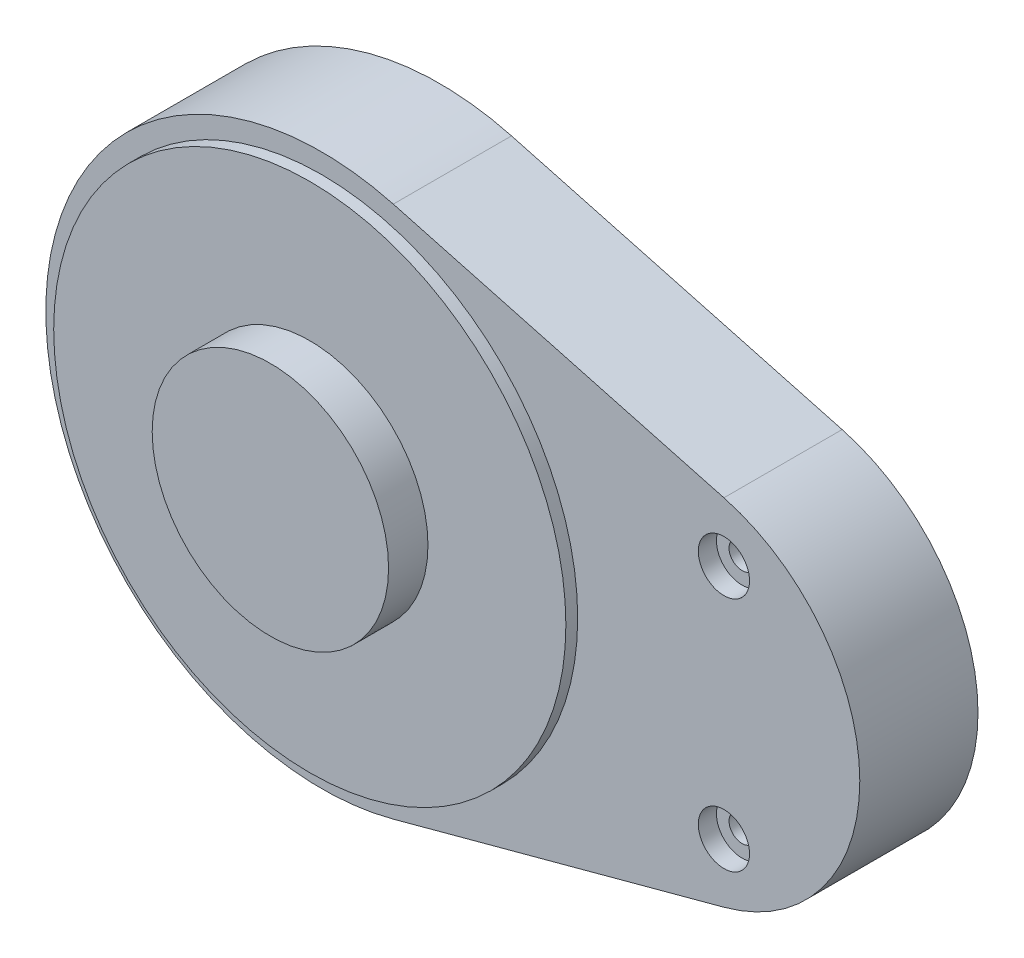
ISO-10303-21;
HEADER;
FILE_DESCRIPTION(('STEP AP214'),'2;1');
FILE_NAME('part.step','',(''),(''),'','','');
FILE_SCHEMA(('AUTOMOTIVE_DESIGN { 1 0 10303 214 1 1 1 1 }'));
ENDSEC;
DATA;
#1=APPLICATION_CONTEXT('core data for automotive mechanical design processes');
#2=APPLICATION_PROTOCOL_DEFINITION('international standard','automotive_design',2000,#1);
#3=PRODUCT_CONTEXT('',#1,'mechanical');
#4=PRODUCT('Part','Part','',(#3));
#5=PRODUCT_RELATED_PRODUCT_CATEGORY('part','',(#4));
#6=PRODUCT_DEFINITION_FORMATION('','',#4);
#7=PRODUCT_DEFINITION_CONTEXT('part definition',#1,'design');
#8=PRODUCT_DEFINITION('design','',#6,#7);
#9=PRODUCT_DEFINITION_SHAPE('','',#8);
#10=(LENGTH_UNIT() NAMED_UNIT(*) SI_UNIT(.MILLI.,.METRE.));
#11=(NAMED_UNIT(*) PLANE_ANGLE_UNIT() SI_UNIT($,.RADIAN.));
#12=(NAMED_UNIT(*) SI_UNIT($,.STERADIAN.) SOLID_ANGLE_UNIT());
#13=UNCERTAINTY_MEASURE_WITH_UNIT(LENGTH_MEASURE(1.E-05),#10,'distance_accuracy_value','');
#14=(GEOMETRIC_REPRESENTATION_CONTEXT(3) GLOBAL_UNCERTAINTY_ASSIGNED_CONTEXT((#13)) GLOBAL_UNIT_ASSIGNED_CONTEXT((#10,
#11,#12)) REPRESENTATION_CONTEXT('',''));
#15=CARTESIAN_POINT('',(0.,0.,0.));
#16=DIRECTION('',(0.,0.,1.));
#17=DIRECTION('',(1.,0.,0.));
#18=AXIS2_PLACEMENT_3D('',#15,#16,#17);
#19=CARTESIAN_POINT('',(0.,127.009473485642,0.));
#20=DIRECTION('',(0.,0.,1.));
#21=DIRECTION('',(1.,0.,0.));
#22=AXIS2_PLACEMENT_3D('',#19,#20,#21);
#23=PLANE('',#22);
#24=CARTESIAN_POINT('',(12.1153844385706,157.009473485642,0.));
#25=DIRECTION('',(0.,0.,1.));
#26=DIRECTION('',(1.,0.,0.));
#27=AXIS2_PLACEMENT_3D('',#24,#25,#26);
#28=CIRCLE('',#27,3.29999999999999);
#29=CARTESIAN_POINT('',(15.4153844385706,157.009473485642,0.));
#30=VERTEX_POINT('',#29);
#31=EDGE_CURVE('E36',#30,#30,#28,.T.);
#32=ORIENTED_EDGE('',*,*,#31,.T.);
#33=EDGE_LOOP('',(#32));
#34=FACE_BOUND('',#33,.T.);
#35=CARTESIAN_POINT('',(12.1153844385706,97.009473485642,0.));
#36=DIRECTION('',(0.,0.,1.));
#37=DIRECTION('',(1.,0.,0.));
#38=AXIS2_PLACEMENT_3D('',#35,#36,#37);
#39=CIRCLE('',#38,3.29999999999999);
#40=CARTESIAN_POINT('',(15.4153844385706,97.009473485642,0.));
#41=VERTEX_POINT('',#40);
#42=EDGE_CURVE('E154',#41,#41,#39,.T.);
#43=ORIENTED_EDGE('',*,*,#42,.T.);
#44=EDGE_LOOP('',(#43));
#45=FACE_BOUND('',#44,.T.);
#46=CARTESIAN_POINT('',(0.,127.009473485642,0.));
#47=DIRECTION('',(0.,0.,1.));
#48=DIRECTION('',(1.,0.,0.));
#49=AXIS2_PLACEMENT_3D('',#46,#47,#48);
#50=CIRCLE('',#49,46.6023877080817);
#51=CARTESIAN_POINT('',(12.1153844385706,82.0094734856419,0.));
#52=VERTEX_POINT('',#51);
#53=CARTESIAN_POINT('',(12.1153844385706,172.009473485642,0.));
#54=VERTEX_POINT('',#53);
#55=EDGE_CURVE('E120',#52,#54,#50,.T.);
#56=ORIENTED_EDGE('',*,*,#55,.F.);
#57=DIRECTION('',(0.965615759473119,0.259973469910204,0.));
#58=VECTOR('',#57,1.);
#59=CARTESIAN_POINT('',(-71.8018571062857,59.4163703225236,0.));
#60=LINE('',#59,#58);
#61=CARTESIAN_POINT('',(-71.8018571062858,59.4163703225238,0.));
#62=VERTEX_POINT('',#61);
#63=EDGE_CURVE('E133',#62,#52,#60,.T.);
#64=ORIENTED_EDGE('',*,*,#63,.F.);
#65=CARTESIAN_POINT('',(-90.0000000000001,127.009473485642,0.));
#66=DIRECTION('',(0.,0.,1.));
#67=DIRECTION('',(1.,0.,0.));
#68=AXIS2_PLACEMENT_3D('',#65,#66,#67);
#69=CIRCLE('',#68,70.0000000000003);
#70=CARTESIAN_POINT('',(-71.8018571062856,194.602576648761,0.));
#71=VERTEX_POINT('',#70);
#72=EDGE_CURVE('E141',#71,#62,#69,.T.);
#73=ORIENTED_EDGE('',*,*,#72,.F.);
#74=DIRECTION('',(-0.965615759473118,0.259973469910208,0.));
#75=VECTOR('',#74,1.);
#76=CARTESIAN_POINT('',(12.1153844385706,172.009473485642,0.));
#77=LINE('',#76,#75);
#78=EDGE_CURVE('E123',#54,#71,#77,.T.);
#79=ORIENTED_EDGE('',*,*,#78,.F.);
#80=EDGE_LOOP('',(#56,#64,#73,#79));
#81=FACE_BOUND('',#80,.T.);
#82=DIRECTION('',(0.,1.,0.));
#83=VECTOR('',#82,1.);
#84=CARTESIAN_POINT('',(-105.,142.009473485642,0.));
#85=LINE('',#84,#83);
#86=CARTESIAN_POINT('',(-105.,112.009473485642,0.));
#87=VERTEX_POINT('',#86);
#88=CARTESIAN_POINT('',(-105.,142.009473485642,0.));
#89=VERTEX_POINT('',#88);
#90=EDGE_CURVE('E119',#87,#89,#85,.T.);
#91=ORIENTED_EDGE('',*,*,#90,.F.);
#92=DIRECTION('',(-1.,0.,0.));
#93=VECTOR('',#92,1.);
#94=CARTESIAN_POINT('',(-105.,112.009473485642,0.));
#95=LINE('',#94,#93);
#96=CARTESIAN_POINT('',(-75.,112.009473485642,0.));
#97=VERTEX_POINT('',#96);
#98=EDGE_CURVE('E116',#97,#87,#95,.T.);
#99=ORIENTED_EDGE('',*,*,#98,.F.);
#100=DIRECTION('',(0.,-1.,0.));
#101=VECTOR('',#100,1.);
#102=CARTESIAN_POINT('',(-75.,142.009473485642,0.));
#103=LINE('',#102,#101);
#104=CARTESIAN_POINT('',(-75.,142.009473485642,0.));
#105=VERTEX_POINT('',#104);
#106=EDGE_CURVE('E54',#105,#97,#103,.T.);
#107=ORIENTED_EDGE('',*,*,#106,.F.);
#108=DIRECTION('',(1.,0.,0.));
#109=VECTOR('',#108,1.);
#110=CARTESIAN_POINT('',(-105.,142.009473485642,0.));
#111=LINE('',#110,#109);
#112=EDGE_CURVE('E49',#89,#105,#111,.T.);
#113=ORIENTED_EDGE('',*,*,#112,.F.);
#114=EDGE_LOOP('',(#91,#99,#107,#113));
#115=FACE_BOUND('',#114,.T.);
#116=ADVANCED_FACE('F32',(#34,#45,#81,#115),#23,.F.);
#117=CARTESIAN_POINT('',(0.,127.009473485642,30.));
#118=DIRECTION('',(0.,0.,-1.));
#119=DIRECTION('',(-1.,0.,0.));
#120=AXIS2_PLACEMENT_3D('',#117,#118,#119);
#121=CYLINDRICAL_SURFACE('',#120,46.6023877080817);
#122=ORIENTED_EDGE('',*,*,#55,.T.);
#123=DIRECTION('',(0.,0.,-1.));
#124=VECTOR('',#123,1.);
#125=CARTESIAN_POINT('',(12.1153844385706,172.009473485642,30.));
#126=LINE('',#125,#124);
#127=CARTESIAN_POINT('',(12.1153844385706,172.009473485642,30.));
#128=VERTEX_POINT('',#127);
#129=EDGE_CURVE('E152',#128,#54,#126,.T.);
#130=ORIENTED_EDGE('',*,*,#129,.F.);
#131=CARTESIAN_POINT('',(0.,127.009473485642,30.));
#132=DIRECTION('',(0.,0.,1.));
#133=DIRECTION('',(1.,0.,0.));
#134=AXIS2_PLACEMENT_3D('',#131,#132,#133);
#135=CIRCLE('',#134,46.6023877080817);
#136=CARTESIAN_POINT('',(12.1153844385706,82.0094734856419,30.));
#137=VERTEX_POINT('',#136);
#138=EDGE_CURVE('E129',#137,#128,#135,.T.);
#139=ORIENTED_EDGE('',*,*,#138,.F.);
#140=DIRECTION('',(0.,0.,-1.));
#141=VECTOR('',#140,1.);
#142=CARTESIAN_POINT('',(12.1153844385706,82.0094734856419,30.));
#143=LINE('',#142,#141);
#144=EDGE_CURVE('E138',#137,#52,#143,.T.);
#145=ORIENTED_EDGE('',*,*,#144,.T.);
#146=EDGE_LOOP('',(#122,#130,#139,#145));
#147=FACE_BOUND('',#146,.T.);
#148=ADVANCED_FACE('F34',(#147),#121,.T.);
#149=CARTESIAN_POINT('',(12.1153844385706,172.009473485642,30.));
#150=DIRECTION('',(-0.259973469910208,-0.965615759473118,0.));
#151=DIRECTION('',(0.965615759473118,-0.259973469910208,0.));
#152=AXIS2_PLACEMENT_3D('',#149,#150,#151);
#153=PLANE('',#152);
#154=ORIENTED_EDGE('',*,*,#78,.T.);
#155=DIRECTION('',(0.,0.,-1.));
#156=VECTOR('',#155,1.);
#157=CARTESIAN_POINT('',(-71.8018571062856,194.602576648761,30.));
#158=LINE('',#157,#156);
#159=CARTESIAN_POINT('',(-71.8018571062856,194.602576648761,30.));
#160=VERTEX_POINT('',#159);
#161=EDGE_CURVE('E149',#160,#71,#158,.T.);
#162=ORIENTED_EDGE('',*,*,#161,.F.);
#163=DIRECTION('',(-0.965615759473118,0.259973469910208,0.));
#164=VECTOR('',#163,1.);
#165=CARTESIAN_POINT('',(12.1153844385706,172.009473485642,30.));
#166=LINE('',#165,#164);
#167=EDGE_CURVE('E132',#128,#160,#166,.T.);
#168=ORIENTED_EDGE('',*,*,#167,.F.);
#169=ORIENTED_EDGE('',*,*,#129,.T.);
#170=EDGE_LOOP('',(#154,#162,#168,#169));
#171=FACE_BOUND('',#170,.T.);
#172=ADVANCED_FACE('F205',(#171),#153,.F.);
#173=CARTESIAN_POINT('',(-90.0000000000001,127.009473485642,30.));
#174=DIRECTION('',(0.,0.,-1.));
#175=DIRECTION('',(-1.,0.,0.));
#176=AXIS2_PLACEMENT_3D('',#173,#174,#175);
#177=CYLINDRICAL_SURFACE('',#176,70.0000000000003);
#178=ORIENTED_EDGE('',*,*,#72,.T.);
#179=DIRECTION('',(0.,0.,-1.));
#180=VECTOR('',#179,1.);
#181=CARTESIAN_POINT('',(-71.8018571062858,59.4163703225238,30.));
#182=LINE('',#181,#180);
#183=CARTESIAN_POINT('',(-71.8018571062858,59.4163703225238,30.));
#184=VERTEX_POINT('',#183);
#185=EDGE_CURVE('E146',#184,#62,#182,.T.);
#186=ORIENTED_EDGE('',*,*,#185,.F.);
#187=CARTESIAN_POINT('',(-90.0000000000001,127.009473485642,30.));
#188=DIRECTION('',(0.,0.,1.));
#189=DIRECTION('',(1.,0.,0.));
#190=AXIS2_PLACEMENT_3D('',#187,#188,#189);
#191=CIRCLE('',#190,70.0000000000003);
#192=EDGE_CURVE('E135',#160,#184,#191,.T.);
#193=ORIENTED_EDGE('',*,*,#192,.F.);
#194=ORIENTED_EDGE('',*,*,#161,.T.);
#195=EDGE_LOOP('',(#178,#186,#193,#194));
#196=FACE_BOUND('',#195,.T.);
#197=ADVANCED_FACE('F215',(#196),#177,.T.);
#198=CARTESIAN_POINT('',(-71.8018571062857,59.4163703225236,30.));
#199=DIRECTION('',(-0.259973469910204,0.965615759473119,0.));
#200=DIRECTION('',(-0.965615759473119,-0.259973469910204,0.));
#201=AXIS2_PLACEMENT_3D('',#198,#199,#200);
#202=PLANE('',#201);
#203=ORIENTED_EDGE('',*,*,#63,.T.);
#204=ORIENTED_EDGE('',*,*,#144,.F.);
#205=DIRECTION('',(0.965615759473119,0.259973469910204,0.));
#206=VECTOR('',#205,1.);
#207=CARTESIAN_POINT('',(-71.8018571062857,59.4163703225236,30.));
#208=LINE('',#207,#206);
#209=EDGE_CURVE('E137',#184,#137,#208,.T.);
#210=ORIENTED_EDGE('',*,*,#209,.F.);
#211=ORIENTED_EDGE('',*,*,#185,.T.);
#212=EDGE_LOOP('',(#203,#204,#210,#211));
#213=FACE_BOUND('',#212,.T.);
#214=ADVANCED_FACE('F212',(#213),#202,.F.);
#215=CARTESIAN_POINT('',(0.,127.009473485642,30.));
#216=DIRECTION('',(0.,0.,1.));
#217=DIRECTION('',(1.,0.,0.));
#218=AXIS2_PLACEMENT_3D('',#215,#216,#217);
#219=PLANE('',#218);
#220=CARTESIAN_POINT('',(12.1153844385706,157.009473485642,30.));
#221=DIRECTION('',(0.,0.,1.));
#222=DIRECTION('',(1.,0.,0.));
#223=AXIS2_PLACEMENT_3D('',#220,#221,#222);
#224=CIRCLE('',#223,6.5);
#225=CARTESIAN_POINT('',(18.6153844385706,157.009473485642,30.));
#226=VERTEX_POINT('',#225);
#227=EDGE_CURVE('E243',#226,#226,#224,.T.);
#228=ORIENTED_EDGE('',*,*,#227,.F.);
#229=EDGE_LOOP('',(#228));
#230=FACE_BOUND('',#229,.T.);
#231=CARTESIAN_POINT('',(12.1153844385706,97.009473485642,30.));
#232=DIRECTION('',(0.,0.,1.));
#233=DIRECTION('',(1.,0.,0.));
#234=AXIS2_PLACEMENT_3D('',#231,#232,#233);
#235=CIRCLE('',#234,6.5);
#236=CARTESIAN_POINT('',(18.6153844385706,97.009473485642,30.));
#237=VERTEX_POINT('',#236);
#238=EDGE_CURVE('E169',#237,#237,#235,.T.);
#239=ORIENTED_EDGE('',*,*,#238,.F.);
#240=EDGE_LOOP('',(#239));
#241=FACE_BOUND('',#240,.T.);
#242=CARTESIAN_POINT('',(-90.0000000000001,127.009473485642,30.));
#243=DIRECTION('',(0.,0.,1.));
#244=DIRECTION('',(1.,0.,0.));
#245=AXIS2_PLACEMENT_3D('',#242,#243,#244);
#246=CIRCLE('',#245,65.);
#247=CARTESIAN_POINT('',(-25.0000000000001,127.009473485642,30.));
#248=VERTEX_POINT('',#247);
#249=EDGE_CURVE('E41',#248,#248,#246,.T.);
#250=ORIENTED_EDGE('',*,*,#249,.F.);
#251=EDGE_LOOP('',(#250));
#252=FACE_BOUND('',#251,.T.);
#253=ORIENTED_EDGE('',*,*,#138,.T.);
#254=ORIENTED_EDGE('',*,*,#167,.T.);
#255=ORIENTED_EDGE('',*,*,#192,.T.);
#256=ORIENTED_EDGE('',*,*,#209,.T.);
#257=EDGE_LOOP('',(#253,#254,#255,#256));
#258=FACE_BOUND('',#257,.T.);
#259=ADVANCED_FACE('F210',(#230,#241,#252,#258),#219,.T.);
#260=CARTESIAN_POINT('',(-105.,142.009473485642,-10.));
#261=DIRECTION('',(1.,0.,0.));
#262=DIRECTION('',(0.,0.,-1.));
#263=AXIS2_PLACEMENT_3D('',#260,#261,#262);
#264=PLANE('',#263);
#265=ORIENTED_EDGE('',*,*,#90,.T.);
#266=DIRECTION('',(0.,0.,1.));
#267=VECTOR('',#266,1.);
#268=CARTESIAN_POINT('',(-105.,142.009473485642,-10.));
#269=LINE('',#268,#267);
#270=CARTESIAN_POINT('',(-105.,142.009473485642,-10.));
#271=VERTEX_POINT('',#270);
#272=EDGE_CURVE('E100',#271,#89,#269,.T.);
#273=ORIENTED_EDGE('',*,*,#272,.F.);
#274=DIRECTION('',(0.,1.,0.));
#275=VECTOR('',#274,1.);
#276=CARTESIAN_POINT('',(-105.,142.009473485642,-10.));
#277=LINE('',#276,#275);
#278=CARTESIAN_POINT('',(-105.,112.009473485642,-10.));
#279=VERTEX_POINT('',#278);
#280=EDGE_CURVE('E107',#279,#271,#277,.T.);
#281=ORIENTED_EDGE('',*,*,#280,.F.);
#282=DIRECTION('',(0.,0.,1.));
#283=VECTOR('',#282,1.);
#284=CARTESIAN_POINT('',(-105.,112.009473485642,-10.));
#285=LINE('',#284,#283);
#286=EDGE_CURVE('E179',#279,#87,#285,.T.);
#287=ORIENTED_EDGE('',*,*,#286,.T.);
#288=EDGE_LOOP('',(#265,#273,#281,#287));
#289=FACE_BOUND('',#288,.T.);
#290=ADVANCED_FACE('F118',(#289),#264,.F.);
#291=CARTESIAN_POINT('',(-105.,142.009473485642,-10.));
#292=DIRECTION('',(0.,-1.,0.));
#293=DIRECTION('',(0.,0.,-1.));
#294=AXIS2_PLACEMENT_3D('',#291,#292,#293);
#295=PLANE('',#294);
#296=ORIENTED_EDGE('',*,*,#112,.T.);
#297=DIRECTION('',(0.,0.,1.));
#298=VECTOR('',#297,1.);
#299=CARTESIAN_POINT('',(-75.,142.009473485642,-10.));
#300=LINE('',#299,#298);
#301=CARTESIAN_POINT('',(-75.,142.009473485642,-10.));
#302=VERTEX_POINT('',#301);
#303=EDGE_CURVE('E103',#302,#105,#300,.T.);
#304=ORIENTED_EDGE('',*,*,#303,.F.);
#305=DIRECTION('',(1.,0.,0.));
#306=VECTOR('',#305,1.);
#307=CARTESIAN_POINT('',(-105.,142.009473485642,-10.));
#308=LINE('',#307,#306);
#309=EDGE_CURVE('E96',#271,#302,#308,.T.);
#310=ORIENTED_EDGE('',*,*,#309,.F.);
#311=ORIENTED_EDGE('',*,*,#272,.T.);
#312=EDGE_LOOP('',(#296,#304,#310,#311));
#313=FACE_BOUND('',#312,.T.);
#314=ADVANCED_FACE('F98',(#313),#295,.F.);
#315=CARTESIAN_POINT('',(-75.,142.009473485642,-10.));
#316=DIRECTION('',(-1.,0.,0.));
#317=DIRECTION('',(0.,0.,1.));
#318=AXIS2_PLACEMENT_3D('',#315,#316,#317);
#319=PLANE('',#318);
#320=ORIENTED_EDGE('',*,*,#106,.T.);
#321=DIRECTION('',(0.,0.,1.));
#322=VECTOR('',#321,1.);
#323=CARTESIAN_POINT('',(-75.,112.009473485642,-10.));
#324=LINE('',#323,#322);
#325=CARTESIAN_POINT('',(-75.,112.009473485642,-10.));
#326=VERTEX_POINT('',#325);
#327=EDGE_CURVE('E125',#326,#97,#324,.T.);
#328=ORIENTED_EDGE('',*,*,#327,.F.);
#329=DIRECTION('',(0.,-1.,0.));
#330=VECTOR('',#329,1.);
#331=CARTESIAN_POINT('',(-75.,142.009473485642,-10.));
#332=LINE('',#331,#330);
#333=EDGE_CURVE('E106',#302,#326,#332,.T.);
#334=ORIENTED_EDGE('',*,*,#333,.F.);
#335=ORIENTED_EDGE('',*,*,#303,.T.);
#336=EDGE_LOOP('',(#320,#328,#334,#335));
#337=FACE_BOUND('',#336,.T.);
#338=ADVANCED_FACE('F190',(#337),#319,.F.);
#339=CARTESIAN_POINT('',(-105.,112.009473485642,-10.));
#340=DIRECTION('',(0.,1.,0.));
#341=DIRECTION('',(0.,0.,1.));
#342=AXIS2_PLACEMENT_3D('',#339,#340,#341);
#343=PLANE('',#342);
#344=ORIENTED_EDGE('',*,*,#98,.T.);
#345=ORIENTED_EDGE('',*,*,#286,.F.);
#346=DIRECTION('',(-1.,0.,0.));
#347=VECTOR('',#346,1.);
#348=CARTESIAN_POINT('',(-105.,112.009473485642,-10.));
#349=LINE('',#348,#347);
#350=EDGE_CURVE('E112',#326,#279,#349,.T.);
#351=ORIENTED_EDGE('',*,*,#350,.F.);
#352=ORIENTED_EDGE('',*,*,#327,.T.);
#353=EDGE_LOOP('',(#344,#345,#351,#352));
#354=FACE_BOUND('',#353,.T.);
#355=ADVANCED_FACE('F188',(#354),#343,.F.);
#356=CARTESIAN_POINT('',(0.,0.,-10.));
#357=DIRECTION('',(0.,0.,1.));
#358=DIRECTION('',(1.,0.,0.));
#359=AXIS2_PLACEMENT_3D('',#356,#357,#358);
#360=PLANE('',#359);
#361=ORIENTED_EDGE('',*,*,#280,.T.);
#362=ORIENTED_EDGE('',*,*,#309,.T.);
#363=ORIENTED_EDGE('',*,*,#333,.T.);
#364=ORIENTED_EDGE('',*,*,#350,.T.);
#365=EDGE_LOOP('',(#361,#362,#363,#364));
#366=FACE_BOUND('',#365,.T.);
#367=ADVANCED_FACE('F110',(#366),#360,.F.);
#368=CARTESIAN_POINT('',(-90.0000000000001,127.009473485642,33.));
#369=DIRECTION('',(0.,0.,-1.));
#370=DIRECTION('',(-1.,0.,0.));
#371=AXIS2_PLACEMENT_3D('',#368,#369,#370);
#372=CYLINDRICAL_SURFACE('',#371,65.);
#373=CARTESIAN_POINT('',(-90.0000000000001,127.009473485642,33.));
#374=DIRECTION('',(0.,0.,1.));
#375=DIRECTION('',(1.,0.,0.));
#376=AXIS2_PLACEMENT_3D('',#373,#374,#375);
#377=CIRCLE('',#376,65.);
#378=CARTESIAN_POINT('',(-25.0000000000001,127.009473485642,33.));
#379=VERTEX_POINT('',#378);
#380=EDGE_CURVE('E161',#379,#379,#377,.T.);
#381=ORIENTED_EDGE('',*,*,#380,.F.);
#382=EDGE_LOOP('',(#381));
#383=FACE_BOUND('',#382,.T.);
#384=ORIENTED_EDGE('',*,*,#249,.T.);
#385=EDGE_LOOP('',(#384));
#386=FACE_BOUND('',#385,.T.);
#387=ADVANCED_FACE('F249',(#383,#386),#372,.T.);
#388=CARTESIAN_POINT('',(-90.0000000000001,127.009473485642,33.));
#389=DIRECTION('',(0.,0.,1.));
#390=DIRECTION('',(1.,0.,0.));
#391=AXIS2_PLACEMENT_3D('',#388,#389,#390);
#392=PLANE('',#391);
#393=CARTESIAN_POINT('',(-90.0000000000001,127.009473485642,33.));
#394=DIRECTION('',(0.,0.,1.));
#395=DIRECTION('',(1.,0.,0.));
#396=AXIS2_PLACEMENT_3D('',#393,#394,#395);
#397=CIRCLE('',#396,30.);
#398=CARTESIAN_POINT('',(-60.0000000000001,127.009473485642,33.));
#399=VERTEX_POINT('',#398);
#400=EDGE_CURVE('E11',#399,#399,#397,.T.);
#401=ORIENTED_EDGE('',*,*,#400,.F.);
#402=EDGE_LOOP('',(#401));
#403=FACE_BOUND('',#402,.T.);
#404=ORIENTED_EDGE('',*,*,#380,.T.);
#405=EDGE_LOOP('',(#404));
#406=FACE_BOUND('',#405,.T.);
#407=ADVANCED_FACE('F251',(#403,#406),#392,.T.);
#408=CARTESIAN_POINT('',(-90.0000000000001,127.009473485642,43.));
#409=DIRECTION('',(0.,0.,-1.));
#410=DIRECTION('',(-1.,0.,0.));
#411=AXIS2_PLACEMENT_3D('',#408,#409,#410);
#412=CYLINDRICAL_SURFACE('',#411,30.);
#413=CARTESIAN_POINT('',(-90.0000000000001,127.009473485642,43.));
#414=DIRECTION('',(0.,0.,1.));
#415=DIRECTION('',(1.,0.,0.));
#416=AXIS2_PLACEMENT_3D('',#413,#414,#415);
#417=CIRCLE('',#416,30.);
#418=CARTESIAN_POINT('',(-60.0000000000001,127.009473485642,43.));
#419=VERTEX_POINT('',#418);
#420=EDGE_CURVE('E156',#419,#419,#417,.T.);
#421=ORIENTED_EDGE('',*,*,#420,.F.);
#422=EDGE_LOOP('',(#421));
#423=FACE_BOUND('',#422,.T.);
#424=ORIENTED_EDGE('',*,*,#400,.T.);
#425=EDGE_LOOP('',(#424));
#426=FACE_BOUND('',#425,.T.);
#427=ADVANCED_FACE('F258',(#423,#426),#412,.T.);
#428=CARTESIAN_POINT('',(-90.0000000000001,127.009473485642,43.));
#429=DIRECTION('',(0.,0.,1.));
#430=DIRECTION('',(1.,0.,0.));
#431=AXIS2_PLACEMENT_3D('',#428,#429,#430);
#432=PLANE('',#431);
#433=ORIENTED_EDGE('',*,*,#420,.T.);
#434=EDGE_LOOP('',(#433));
#435=FACE_BOUND('',#434,.T.);
#436=ADVANCED_FACE('F266',(#435),#432,.T.);
#437=CARTESIAN_POINT('',(12.1153844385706,97.009473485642,30.));
#438=DIRECTION('',(0.,0.,1.));
#439=DIRECTION('',(1.,0.,0.));
#440=AXIS2_PLACEMENT_3D('',#437,#438,#439);
#441=CYLINDRICAL_SURFACE('',#440,3.29999999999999);
#442=CARTESIAN_POINT('',(12.1153844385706,97.009473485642,25.4));
#443=DIRECTION('',(0.,0.,1.));
#444=DIRECTION('',(1.,0.,0.));
#445=AXIS2_PLACEMENT_3D('',#442,#443,#444);
#446=CIRCLE('',#445,3.29999999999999);
#447=CARTESIAN_POINT('',(15.4153844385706,97.009473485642,25.4));
#448=VERTEX_POINT('',#447);
#449=EDGE_CURVE('E157',#448,#448,#446,.T.);
#450=ORIENTED_EDGE('',*,*,#449,.T.);
#451=EDGE_LOOP('',(#450));
#452=FACE_BOUND('',#451,.T.);
#453=ORIENTED_EDGE('',*,*,#42,.F.);
#454=EDGE_LOOP('',(#453));
#455=FACE_BOUND('',#454,.T.);
#456=ADVANCED_FACE('F270',(#452,#455),#441,.F.);
#457=CARTESIAN_POINT('',(15.4153844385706,97.009473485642,25.4));
#458=DIRECTION('',(0.,0.,-1.));
#459=DIRECTION('',(-1.,0.,0.));
#460=AXIS2_PLACEMENT_3D('',#457,#458,#459);
#461=PLANE('',#460);
#462=ORIENTED_EDGE('',*,*,#449,.F.);
#463=EDGE_LOOP('',(#462));
#464=FACE_BOUND('',#463,.T.);
#465=CARTESIAN_POINT('',(12.1153844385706,97.009473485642,25.4));
#466=DIRECTION('',(0.,0.,1.));
#467=DIRECTION('',(1.,0.,0.));
#468=AXIS2_PLACEMENT_3D('',#465,#466,#467);
#469=CIRCLE('',#468,6.5);
#470=CARTESIAN_POINT('',(18.6153844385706,97.009473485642,25.4));
#471=VERTEX_POINT('',#470);
#472=EDGE_CURVE('E164',#471,#471,#469,.T.);
#473=ORIENTED_EDGE('',*,*,#472,.T.);
#474=EDGE_LOOP('',(#473));
#475=FACE_BOUND('',#474,.T.);
#476=ADVANCED_FACE('F274',(#464,#475),#461,.F.);
#477=CARTESIAN_POINT('',(12.1153844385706,97.009473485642,30.));
#478=DIRECTION('',(0.,0.,1.));
#479=DIRECTION('',(1.,0.,0.));
#480=AXIS2_PLACEMENT_3D('',#477,#478,#479);
#481=CYLINDRICAL_SURFACE('',#480,6.5);
#482=ORIENTED_EDGE('',*,*,#472,.F.);
#483=EDGE_LOOP('',(#482));
#484=FACE_BOUND('',#483,.T.);
#485=ORIENTED_EDGE('',*,*,#238,.T.);
#486=EDGE_LOOP('',(#485));
#487=FACE_BOUND('',#486,.T.);
#488=ADVANCED_FACE('F277',(#484,#487),#481,.F.);
#489=CARTESIAN_POINT('',(12.1153844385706,157.009473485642,30.));
#490=DIRECTION('',(0.,0.,1.));
#491=DIRECTION('',(1.,0.,0.));
#492=AXIS2_PLACEMENT_3D('',#489,#490,#491);
#493=CYLINDRICAL_SURFACE('',#492,3.29999999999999);
#494=CARTESIAN_POINT('',(12.1153844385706,157.009473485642,25.4));
#495=DIRECTION('',(0.,0.,1.));
#496=DIRECTION('',(1.,0.,0.));
#497=AXIS2_PLACEMENT_3D('',#494,#495,#496);
#498=CIRCLE('',#497,3.29999999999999);
#499=CARTESIAN_POINT('',(15.4153844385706,157.009473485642,25.4));
#500=VERTEX_POINT('',#499);
#501=EDGE_CURVE('E300',#500,#500,#498,.T.);
#502=ORIENTED_EDGE('',*,*,#501,.T.);
#503=EDGE_LOOP('',(#502));
#504=FACE_BOUND('',#503,.T.);
#505=ORIENTED_EDGE('',*,*,#31,.F.);
#506=EDGE_LOOP('',(#505));
#507=FACE_BOUND('',#506,.T.);
#508=ADVANCED_FACE('F281',(#504,#507),#493,.F.);
#509=CARTESIAN_POINT('',(15.4153844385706,157.009473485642,25.4));
#510=DIRECTION('',(0.,0.,-1.));
#511=DIRECTION('',(-1.,0.,0.));
#512=AXIS2_PLACEMENT_3D('',#509,#510,#511);
#513=PLANE('',#512);
#514=ORIENTED_EDGE('',*,*,#501,.F.);
#515=EDGE_LOOP('',(#514));
#516=FACE_BOUND('',#515,.T.);
#517=CARTESIAN_POINT('',(12.1153844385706,157.009473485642,25.4));
#518=DIRECTION('',(0.,0.,1.));
#519=DIRECTION('',(1.,0.,0.));
#520=AXIS2_PLACEMENT_3D('',#517,#518,#519);
#521=CIRCLE('',#520,6.5);
#522=CARTESIAN_POINT('',(18.6153844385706,157.009473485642,25.4));
#523=VERTEX_POINT('',#522);
#524=EDGE_CURVE('E298',#523,#523,#521,.T.);
#525=ORIENTED_EDGE('',*,*,#524,.T.);
#526=EDGE_LOOP('',(#525));
#527=FACE_BOUND('',#526,.T.);
#528=ADVANCED_FACE('F285',(#516,#527),#513,.F.);
#529=CARTESIAN_POINT('',(12.1153844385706,157.009473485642,30.));
#530=DIRECTION('',(0.,0.,1.));
#531=DIRECTION('',(1.,0.,0.));
#532=AXIS2_PLACEMENT_3D('',#529,#530,#531);
#533=CYLINDRICAL_SURFACE('',#532,6.5);
#534=ORIENTED_EDGE('',*,*,#524,.F.);
#535=EDGE_LOOP('',(#534));
#536=FACE_BOUND('',#535,.T.);
#537=ORIENTED_EDGE('',*,*,#227,.T.);
#538=EDGE_LOOP('',(#537));
#539=FACE_BOUND('',#538,.T.);
#540=ADVANCED_FACE('F289',(#536,#539),#533,.F.);
#541=CLOSED_SHELL('',(#116,#148,#172,#197,#214,#259,#290,#314,#338,#355,#367,#387,#407,#427,
#436,#456,#476,#488,#508,#528,#540));
#542=MANIFOLD_SOLID_BREP('B2',#541);
#543=ADVANCED_BREP_SHAPE_REPRESENTATION('',(#18,#542),#14);
#544=SHAPE_DEFINITION_REPRESENTATION(#9,#543);
ENDSEC;
END-ISO-10303-21;
